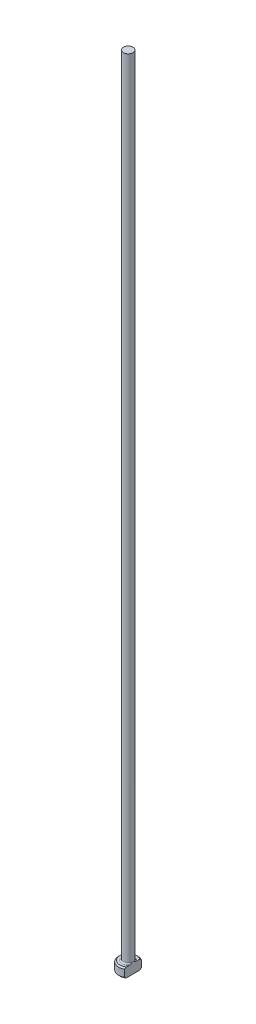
ISO-10303-21;
HEADER;
FILE_DESCRIPTION(('STEP AP214'),'2;1');
FILE_NAME('part.step','',(''),(''),'','','');
FILE_SCHEMA(('AUTOMOTIVE_DESIGN { 1 0 10303 214 1 1 1 1 }'));
ENDSEC;
DATA;
#1=APPLICATION_CONTEXT('core data for automotive mechanical design processes');
#2=APPLICATION_PROTOCOL_DEFINITION('international standard','automotive_design',2000,#1);
#3=PRODUCT_CONTEXT('',#1,'mechanical');
#4=PRODUCT('Part','Part','',(#3));
#5=PRODUCT_RELATED_PRODUCT_CATEGORY('part','',(#4));
#6=PRODUCT_DEFINITION_FORMATION('','',#4);
#7=PRODUCT_DEFINITION_CONTEXT('part definition',#1,'design');
#8=PRODUCT_DEFINITION('design','',#6,#7);
#9=PRODUCT_DEFINITION_SHAPE('','',#8);
#10=(LENGTH_UNIT() NAMED_UNIT(*) SI_UNIT(.MILLI.,.METRE.));
#11=(NAMED_UNIT(*) PLANE_ANGLE_UNIT() SI_UNIT($,.RADIAN.));
#12=(NAMED_UNIT(*) SI_UNIT($,.STERADIAN.) SOLID_ANGLE_UNIT());
#13=UNCERTAINTY_MEASURE_WITH_UNIT(LENGTH_MEASURE(1.E-05),#10,'distance_accuracy_value','');
#14=(GEOMETRIC_REPRESENTATION_CONTEXT(3) GLOBAL_UNCERTAINTY_ASSIGNED_CONTEXT((#13)) GLOBAL_UNIT_ASSIGNED_CONTEXT((#10,
#11,#12)) REPRESENTATION_CONTEXT('',''));
#15=CARTESIAN_POINT('',(0.,0.,0.));
#16=DIRECTION('',(0.,0.,1.));
#17=DIRECTION('',(1.,0.,0.));
#18=AXIS2_PLACEMENT_3D('',#15,#16,#17);
#19=CARTESIAN_POINT('',(0.,0.,0.));
#20=DIRECTION('',(0.,-1.,0.));
#21=DIRECTION('',(0.,0.,-1.));
#22=AXIS2_PLACEMENT_3D('',#19,#20,#21);
#23=PLANE('',#22);
#24=CARTESIAN_POINT('',(0.,0.,0.));
#25=DIRECTION('',(0.,-1.,0.));
#26=DIRECTION('',(0.,0.,-1.));
#27=AXIS2_PLACEMENT_3D('',#24,#25,#26);
#28=CIRCLE('',#27,1.29999999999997);
#29=CARTESIAN_POINT('',(0.749999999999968,0.,1.06183802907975));
#30=VERTEX_POINT('',#29);
#31=CARTESIAN_POINT('',(0.749999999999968,0.,-1.06183802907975));
#32=VERTEX_POINT('',#31);
#33=EDGE_CURVE('E98',#30,#32,#28,.T.);
#34=ORIENTED_EDGE('',*,*,#33,.T.);
#35=DIRECTION('',(0.,0.,1.));
#36=VECTOR('',#35,1.);
#37=CARTESIAN_POINT('',(0.749999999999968,0.,-1.29903810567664));
#38=LINE('',#37,#36);
#39=EDGE_CURVE('E83',#32,#30,#38,.T.);
#40=ORIENTED_EDGE('',*,*,#39,.T.);
#41=EDGE_LOOP('',(#34,#40));
#42=FACE_BOUND('',#41,.T.);
#43=ADVANCED_FACE('F32',(#42),#23,.T.);
#44=CARTESIAN_POINT('',(0.,259.958771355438,0.));
#45=DIRECTION('',(0.,1.,0.));
#46=DIRECTION('',(0.,0.,1.));
#47=AXIS2_PLACEMENT_3D('',#44,#45,#46);
#48=CYLINDRICAL_SURFACE('',#47,1.49999999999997);
#49=CARTESIAN_POINT('',(0.,1.29999999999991,0.));
#50=DIRECTION('',(0.,1.,0.));
#51=DIRECTION('',(0.,0.,1.));
#52=AXIS2_PLACEMENT_3D('',#49,#50,#51);
#53=CIRCLE('',#52,1.49999999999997);
#54=CARTESIAN_POINT('',(0.749999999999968,1.29999999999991,1.29903810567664));
#55=VERTEX_POINT('',#54);
#56=CARTESIAN_POINT('',(0.749999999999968,1.29999999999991,-1.29903810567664));
#57=VERTEX_POINT('',#56);
#58=EDGE_CURVE('E104',#55,#57,#53,.F.);
#59=ORIENTED_EDGE('',*,*,#58,.T.);
#60=DIRECTION('',(0.,-1.,0.));
#61=VECTOR('',#60,1.);
#62=CARTESIAN_POINT('',(0.749999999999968,125.,-1.29903810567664));
#63=LINE('',#62,#61);
#64=CARTESIAN_POINT('',(0.749999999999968,0.200000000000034,-1.29903810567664));
#65=VERTEX_POINT('',#64);
#66=EDGE_CURVE('E183',#57,#65,#63,.T.);
#67=ORIENTED_EDGE('',*,*,#66,.T.);
#68=CARTESIAN_POINT('',(0.,0.200000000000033,0.));
#69=DIRECTION('',(0.,-1.,0.));
#70=DIRECTION('',(0.,0.,-1.));
#71=AXIS2_PLACEMENT_3D('',#68,#69,#70);
#72=CIRCLE('',#71,1.49999999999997);
#73=CARTESIAN_POINT('',(0.749999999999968,0.200000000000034,1.29903810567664));
#74=VERTEX_POINT('',#73);
#75=EDGE_CURVE('E100',#65,#74,#72,.F.);
#76=ORIENTED_EDGE('',*,*,#75,.T.);
#77=DIRECTION('',(0.,-1.,0.));
#78=VECTOR('',#77,1.);
#79=CARTESIAN_POINT('',(0.749999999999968,125.,1.29903810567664));
#80=LINE('',#79,#78);
#81=EDGE_CURVE('E93',#55,#74,#80,.T.);
#82=ORIENTED_EDGE('',*,*,#81,.F.);
#83=EDGE_LOOP('',(#59,#67,#76,#82));
#84=FACE_BOUND('',#83,.T.);
#85=ADVANCED_FACE('F158',(#84),#48,.T.);
#86=CARTESIAN_POINT('',(-1.49999999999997,1.5,0.));
#87=DIRECTION('',(0.,1.,0.));
#88=DIRECTION('',(0.,0.,1.));
#89=AXIS2_PLACEMENT_3D('',#86,#87,#88);
#90=PLANE('',#89);
#91=CARTESIAN_POINT('',(0.,1.5,0.));
#92=DIRECTION('',(0.,1.,0.));
#93=DIRECTION('',(0.,0.,1.));
#94=AXIS2_PLACEMENT_3D('',#91,#92,#93);
#95=CIRCLE('',#94,1.29999999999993);
#96=CARTESIAN_POINT('',(0.749999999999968,1.5,-1.0618380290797));
#97=VERTEX_POINT('',#96);
#98=CARTESIAN_POINT('',(0.749999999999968,1.5,1.0618380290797));
#99=VERTEX_POINT('',#98);
#100=EDGE_CURVE('E178',#97,#99,#95,.T.);
#101=ORIENTED_EDGE('',*,*,#100,.T.);
#102=DIRECTION('',(0.,0.,-1.));
#103=VECTOR('',#102,1.);
#104=CARTESIAN_POINT('',(0.749999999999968,1.5,0.));
#105=LINE('',#104,#103);
#106=CARTESIAN_POINT('',(0.749999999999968,1.49999999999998,0.583095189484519));
#107=VERTEX_POINT('',#106);
#108=EDGE_CURVE('E57',#99,#107,#105,.T.);
#109=ORIENTED_EDGE('',*,*,#108,.T.);
#110=CARTESIAN_POINT('',(0.,1.5,0.));
#111=DIRECTION('',(0.,1.,0.));
#112=DIRECTION('',(0.,0.,1.));
#113=AXIS2_PLACEMENT_3D('',#110,#111,#112);
#114=CIRCLE('',#113,0.949999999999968);
#115=CARTESIAN_POINT('',(0.749999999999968,1.49999999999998,-0.583095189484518));
#116=VERTEX_POINT('',#115);
#117=EDGE_CURVE('E107',#107,#116,#114,.F.);
#118=ORIENTED_EDGE('',*,*,#117,.T.);
#119=EDGE_CURVE('E136',#116,#97,#105,.T.);
#120=ORIENTED_EDGE('',*,*,#119,.T.);
#121=EDGE_LOOP('',(#101,#109,#118,#120));
#122=FACE_BOUND('',#121,.T.);
#123=ADVANCED_FACE('F147',(#122),#90,.T.);
#124=CARTESIAN_POINT('',(0.,1.5,0.));
#125=DIRECTION('',(0.,-1.,0.));
#126=DIRECTION('',(0.,0.,-1.));
#127=AXIS2_PLACEMENT_3D('',#124,#125,#126);
#128=CONICAL_SURFACE('',#127,1.29999999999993,0.785398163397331);
#129=ORIENTED_EDGE('',*,*,#58,.F.);
#130=CARTESIAN_POINT('',(0.749999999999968,-0.159311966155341,2.86269581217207));
#131=CARTESIAN_POINT('',(0.749999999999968,-0.0964328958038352,2.79769204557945));
#132=CARTESIAN_POINT('',(0.749999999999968,-0.0336221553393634,2.73262201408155));
#133=CARTESIAN_POINT('',(0.749999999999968,0.0918244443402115,2.60231208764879));
#134=CARTESIAN_POINT('',(0.749999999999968,0.154460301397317,2.53707219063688));
#135=CARTESIAN_POINT('',(0.749999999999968,0.342109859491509,2.34097725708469));
#136=CARTESIAN_POINT('',(0.749999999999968,0.466801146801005,2.20981339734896));
#137=CARTESIAN_POINT('',(0.749999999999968,0.712328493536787,1.94880342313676));
#138=CARTESIAN_POINT('',(0.749999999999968,0.833191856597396,1.81898315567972));
#139=CARTESIAN_POINT('',(0.749999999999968,1.01264761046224,1.62259577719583));
#140=CARTESIAN_POINT('',(0.749999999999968,1.07215326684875,1.55686440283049));
#141=CARTESIAN_POINT('',(0.749999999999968,1.19029260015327,1.42462307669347));
#142=CARTESIAN_POINT('',(0.749999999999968,1.24892630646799,1.35811315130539));
#143=CARTESIAN_POINT('',(0.749999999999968,1.34237202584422,1.250039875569));
#144=CARTESIAN_POINT('',(0.749999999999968,1.37758720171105,1.20882554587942));
#145=CARTESIAN_POINT('',(0.749999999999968,1.44738925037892,1.12585980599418));
#146=CARTESIAN_POINT('',(0.749999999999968,1.48197606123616,1.08410834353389));
#147=CARTESIAN_POINT('',(0.749999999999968,1.55066668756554,0.999475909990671));
#148=CARTESIAN_POINT('',(0.749999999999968,1.58476158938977,0.956587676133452));
#149=CARTESIAN_POINT('',(0.749999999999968,1.65176028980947,0.869892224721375));
#150=CARTESIAN_POINT('',(0.749999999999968,1.68466421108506,0.826085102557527));
#151=CARTESIAN_POINT('',(0.749999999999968,1.74926316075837,0.736563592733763));
#152=CARTESIAN_POINT('',(0.749999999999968,1.78093229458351,0.690830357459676));
#153=CARTESIAN_POINT('',(0.749999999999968,1.84170221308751,0.597569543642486));
#154=CARTESIAN_POINT('',(0.749999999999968,1.87079946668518,0.550039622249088));
#155=CARTESIAN_POINT('',(0.749999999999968,1.92458416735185,0.453275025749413));
#156=CARTESIAN_POINT('',(0.749999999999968,1.94932190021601,0.404068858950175));
#157=CARTESIAN_POINT('',(0.749999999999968,1.99240172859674,0.302953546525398));
#158=CARTESIAN_POINT('',(0.749999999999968,2.0107652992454,0.251054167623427));
#159=CARTESIAN_POINT('',(0.749999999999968,2.03062801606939,0.173219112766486));
#160=CARTESIAN_POINT('',(0.749999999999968,2.03589389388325,0.148243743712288));
#161=CARTESIAN_POINT('',(0.749999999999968,2.04404463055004,0.0979002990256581));
#162=CARTESIAN_POINT('',(0.749999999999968,2.04692969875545,0.0725322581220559));
#163=CARTESIAN_POINT('',(0.749999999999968,2.05011277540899,0.0217085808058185));
#164=CARTESIAN_POINT('',(0.749999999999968,2.05041870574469,-0.00374654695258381));
#165=CARTESIAN_POINT('',(0.749999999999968,2.04844884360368,-0.054551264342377));
#166=CARTESIAN_POINT('',(0.749999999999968,2.04617283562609,-0.0799008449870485));
#167=CARTESIAN_POINT('',(0.749999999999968,2.03574038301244,-0.154989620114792));
#168=CARTESIAN_POINT('',(0.749999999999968,2.02400532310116,-0.204255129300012));
#169=CARTESIAN_POINT('',(0.749999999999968,2.00101199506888,-0.276434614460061));
#170=CARTESIAN_POINT('',(0.749999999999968,1.99241146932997,-0.300284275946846));
#171=CARTESIAN_POINT('',(0.749999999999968,1.97373056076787,-0.347397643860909));
#172=CARTESIAN_POINT('',(0.749999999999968,1.96365048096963,-0.370661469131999));
#173=CARTESIAN_POINT('',(0.749999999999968,1.93147369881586,-0.439916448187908));
#174=CARTESIAN_POINT('',(0.749999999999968,1.90754987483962,-0.485052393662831));
#175=CARTESIAN_POINT('',(0.749999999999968,1.85653851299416,-0.573518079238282));
#176=CARTESIAN_POINT('',(0.749999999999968,1.82944709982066,-0.616845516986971));
#177=CARTESIAN_POINT('',(0.749999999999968,1.77305281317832,-0.70224758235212));
#178=CARTESIAN_POINT('',(0.749999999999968,1.74374234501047,-0.74431715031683));
#179=CARTESIAN_POINT('',(0.749999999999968,1.68364081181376,-0.827390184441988));
#180=CARTESIAN_POINT('',(0.749999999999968,1.65284939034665,-0.868393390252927));
#181=CARTESIAN_POINT('',(0.749999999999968,1.55811585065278,-0.991236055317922));
#182=CARTESIAN_POINT('',(0.749999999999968,1.49256261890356,-1.07182756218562));
#183=CARTESIAN_POINT('',(0.749999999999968,1.35929153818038,-1.23084604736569));
#184=CARTESIAN_POINT('',(0.749999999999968,1.29157909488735,-1.30927763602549));
#185=CARTESIAN_POINT('',(0.749999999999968,1.16634991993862,-1.45163734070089));
#186=CARTESIAN_POINT('',(0.749999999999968,1.10905780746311,-1.51576342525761));
#187=CARTESIAN_POINT('',(0.749999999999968,0.993771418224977,-1.64338257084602));
#188=CARTESIAN_POINT('',(0.749999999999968,0.935777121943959,-1.70687561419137));
#189=CARTESIAN_POINT('',(0.749999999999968,0.76093084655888,-1.89677871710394));
#190=CARTESIAN_POINT('',(0.749999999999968,0.643323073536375,-2.02249209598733));
#191=CARTESIAN_POINT('',(0.749999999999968,0.41182883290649,-2.26768837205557));
#192=CARTESIAN_POINT('',(0.749999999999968,0.297988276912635,-2.38721485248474));
#193=CARTESIAN_POINT('',(0.749999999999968,0.069723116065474,-2.62545352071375));
#194=CARTESIAN_POINT('',(0.749999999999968,-0.0447006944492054,-2.74416646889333));
#195=CARTESIAN_POINT('',(0.749999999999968,-0.15931196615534,-2.86269581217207));
#196=B_SPLINE_CURVE_WITH_KNOTS('',3,(#130,#131,#132,#133,#134,#135,#136,#137,#138,#139,#140,
#141,#142,#143,#144,#145,#146,#147,#148,#149,#150,#151,#152,#153,#154,#155,#156,#157,#158,#159,
#160,#161,#162,#163,#164,#165,#166,#167,#168,#169,#170,#171,#172,#173,#174,#175,#176,#177,#178,
#179,#180,#181,#182,#183,#184,#185,#186,#187,#188,#189,#190,#191,#192,#193,#194,#195),
.UNSPECIFIED.,.F.,.F.,(4,2,2,2,2,2,2,2,2,2,2,2,2,2,2,2,2,2,2,2,2,2,2,2,2,2,2,2,2,2,2,2,4),(0.,
0.271318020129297,0.542639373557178,1.08555961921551,1.61765797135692,1.88364922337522,
2.14963148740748,2.31225703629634,2.47489853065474,2.63925165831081,2.80358780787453,
2.97041571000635,3.13746921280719,3.3024477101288,3.46686485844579,3.54334114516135,
3.61981070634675,3.69604530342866,3.77228626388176,3.92333298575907,3.99936293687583,
4.07537733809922,4.22841106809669,4.38163402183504,4.5354074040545,4.68921798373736,
5.00077730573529,5.31160990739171,5.56957672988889,5.82755073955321,6.34398366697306,
6.83917444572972,7.33381214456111),.UNSPECIFIED.);
#197=EDGE_CURVE('E135',#55,#99,#196,.T.);
#198=ORIENTED_EDGE('',*,*,#197,.T.);
#199=ORIENTED_EDGE('',*,*,#100,.F.);
#200=EDGE_CURVE('E127',#97,#57,#196,.T.);
#201=ORIENTED_EDGE('',*,*,#200,.T.);
#202=EDGE_LOOP('',(#129,#198,#199,#201));
#203=FACE_BOUND('',#202,.T.);
#204=ADVANCED_FACE('F143',(#203),#128,.T.);
#205=CARTESIAN_POINT('',(0.,0.200000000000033,0.));
#206=DIRECTION('',(0.,1.,0.));
#207=DIRECTION('',(0.,0.,1.));
#208=AXIS2_PLACEMENT_3D('',#205,#206,#207);
#209=CONICAL_SURFACE('',#208,1.49999999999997,0.785398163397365);
#210=ORIENTED_EDGE('',*,*,#75,.F.);
#211=CARTESIAN_POINT('',(0.749999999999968,1.65931196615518,-2.86269581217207));
#212=CARTESIAN_POINT('',(0.749999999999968,1.59643289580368,-2.79769204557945));
#213=CARTESIAN_POINT('',(0.749999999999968,1.53362215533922,-2.73262201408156));
#214=CARTESIAN_POINT('',(0.749999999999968,1.40817555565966,-2.60231208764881));
#215=CARTESIAN_POINT('',(0.749999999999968,1.34553969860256,-2.53707219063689));
#216=CARTESIAN_POINT('',(0.749999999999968,1.15789014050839,-2.34097725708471));
#217=CARTESIAN_POINT('',(0.749999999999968,1.03319885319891,-2.20981339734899));
#218=CARTESIAN_POINT('',(0.749999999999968,0.787671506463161,-1.9488034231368));
#219=CARTESIAN_POINT('',(0.749999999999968,0.666808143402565,-1.81898315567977));
#220=CARTESIAN_POINT('',(0.749999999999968,0.487352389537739,-1.6225957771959));
#221=CARTESIAN_POINT('',(0.749999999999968,0.427846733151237,-1.55686440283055));
#222=CARTESIAN_POINT('',(0.749999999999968,0.309707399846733,-1.42462307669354));
#223=CARTESIAN_POINT('',(0.749999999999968,0.251073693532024,-1.35811315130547));
#224=CARTESIAN_POINT('',(0.749999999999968,0.157627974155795,-1.25003987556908));
#225=CARTESIAN_POINT('',(0.749999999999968,0.122412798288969,-1.2088255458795));
#226=CARTESIAN_POINT('',(0.749999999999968,0.0526107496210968,-1.12585980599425));
#227=CARTESIAN_POINT('',(0.749999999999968,0.0180239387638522,-1.08410834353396));
#228=CARTESIAN_POINT('',(0.749999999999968,-0.0506666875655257,-0.999475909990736));
#229=CARTESIAN_POINT('',(0.749999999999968,-0.0847615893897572,-0.956587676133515));
#230=CARTESIAN_POINT('',(0.749999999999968,-0.151760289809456,-0.869892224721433));
#231=CARTESIAN_POINT('',(0.749999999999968,-0.184664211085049,-0.826085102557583));
#232=CARTESIAN_POINT('',(0.749999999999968,-0.249263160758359,-0.736563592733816));
#233=CARTESIAN_POINT('',(0.749999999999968,-0.280932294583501,-0.690830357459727));
#234=CARTESIAN_POINT('',(0.749999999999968,-0.3417022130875,-0.597569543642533));
#235=CARTESIAN_POINT('',(0.749999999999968,-0.370799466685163,-0.550039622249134));
#236=CARTESIAN_POINT('',(0.749999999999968,-0.424584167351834,-0.453275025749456));
#237=CARTESIAN_POINT('',(0.749999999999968,-0.449321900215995,-0.404068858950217));
#238=CARTESIAN_POINT('',(0.749999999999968,-0.492401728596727,-0.302953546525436));
#239=CARTESIAN_POINT('',(0.749999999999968,-0.510765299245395,-0.251054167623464));
#240=CARTESIAN_POINT('',(0.749999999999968,-0.530628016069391,-0.173219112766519));
#241=CARTESIAN_POINT('',(0.749999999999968,-0.535893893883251,-0.148243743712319));
#242=CARTESIAN_POINT('',(0.749999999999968,-0.544044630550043,-0.0979002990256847));
#243=CARTESIAN_POINT('',(0.749999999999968,-0.546929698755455,-0.07253225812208));
#244=CARTESIAN_POINT('',(0.749999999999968,-0.550112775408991,-0.0217085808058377));
#245=CARTESIAN_POINT('',(0.749999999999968,-0.550418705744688,0.0037465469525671));
#246=CARTESIAN_POINT('',(0.749999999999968,-0.54844884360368,0.0545512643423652));
#247=CARTESIAN_POINT('',(0.749999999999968,-0.546172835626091,0.0799008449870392));
#248=CARTESIAN_POINT('',(0.749999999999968,-0.535740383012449,0.15498962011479));
#249=CARTESIAN_POINT('',(0.749999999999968,-0.524005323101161,0.204255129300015));
#250=CARTESIAN_POINT('',(0.749999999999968,-0.50101199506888,0.276434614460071));
#251=CARTESIAN_POINT('',(0.749999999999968,-0.49241146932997,0.300284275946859));
#252=CARTESIAN_POINT('',(0.749999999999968,-0.473730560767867,0.347397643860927));
#253=CARTESIAN_POINT('',(0.749999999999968,-0.463650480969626,0.370661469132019));
#254=CARTESIAN_POINT('',(0.749999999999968,-0.431473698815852,0.439916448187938));
#255=CARTESIAN_POINT('',(0.749999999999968,-0.407549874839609,0.485052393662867));
#256=CARTESIAN_POINT('',(0.749999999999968,-0.356538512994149,0.573518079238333));
#257=CARTESIAN_POINT('',(0.749999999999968,-0.329447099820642,0.616845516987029));
#258=CARTESIAN_POINT('',(0.749999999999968,-0.273052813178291,0.702247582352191));
#259=CARTESIAN_POINT('',(0.749999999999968,-0.243742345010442,0.744317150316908));
#260=CARTESIAN_POINT('',(0.749999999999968,-0.183640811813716,0.827390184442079));
#261=CARTESIAN_POINT('',(0.749999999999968,-0.152849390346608,0.868393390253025));
#262=CARTESIAN_POINT('',(0.749999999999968,-0.0581158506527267,0.99123605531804));
#263=CARTESIAN_POINT('',(0.749999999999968,0.00743738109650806,1.07182756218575));
#264=CARTESIAN_POINT('',(0.749999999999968,0.140708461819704,1.23084604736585));
#265=CARTESIAN_POINT('',(0.749999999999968,0.208420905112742,1.30927763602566));
#266=CARTESIAN_POINT('',(0.749999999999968,0.333650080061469,1.45163734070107));
#267=CARTESIAN_POINT('',(0.749999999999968,0.390942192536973,1.51576342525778));
#268=CARTESIAN_POINT('',(0.749999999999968,0.506228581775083,1.64338257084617));
#269=CARTESIAN_POINT('',(0.749999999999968,0.56422287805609,1.70687561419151));
#270=CARTESIAN_POINT('',(0.749999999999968,0.739069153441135,1.89677871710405));
#271=CARTESIAN_POINT('',(0.749999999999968,0.856676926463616,2.02249209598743));
#272=CARTESIAN_POINT('',(0.749999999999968,1.08817116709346,2.26768837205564));
#273=CARTESIAN_POINT('',(0.749999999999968,1.20201172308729,2.3872148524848));
#274=CARTESIAN_POINT('',(0.749999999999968,1.43027688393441,2.62545352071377));
#275=CARTESIAN_POINT('',(0.749999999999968,1.54470069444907,2.74416646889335));
#276=CARTESIAN_POINT('',(0.749999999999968,1.65931196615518,2.86269581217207));
#277=B_SPLINE_CURVE_WITH_KNOTS('',3,(#211,#212,#213,#214,#215,#216,#217,#218,#219,#220,#221,
#222,#223,#224,#225,#226,#227,#228,#229,#230,#231,#232,#233,#234,#235,#236,#237,#238,#239,#240,
#241,#242,#243,#244,#245,#246,#247,#248,#249,#250,#251,#252,#253,#254,#255,#256,#257,#258,#259,
#260,#261,#262,#263,#264,#265,#266,#267,#268,#269,#270,#271,#272,#273,#274,#275,#276),
.UNSPECIFIED.,.F.,.F.,(4,2,2,2,2,2,2,2,2,2,2,2,2,2,2,2,2,2,2,2,2,2,2,2,2,2,2,2,2,2,2,2,4),(0.,
0.271318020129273,0.542639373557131,1.08555961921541,1.61765797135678,1.88364922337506,
2.1496314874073,2.31225703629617,2.47489853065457,2.63925165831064,2.80358780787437,
2.9704157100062,3.13746921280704,3.30244771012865,3.46686485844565,3.54334114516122,
3.61981070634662,3.69604530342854,3.77228626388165,3.92333298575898,3.99936293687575,
4.07537733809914,4.22841106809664,4.38163402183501,4.53540740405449,4.68921798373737,
5.00077730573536,5.31160990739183,5.56957672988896,5.82755073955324,6.34398366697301,
6.83917444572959,7.33381214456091),.UNSPECIFIED.);
#278=EDGE_CURVE('E86',#65,#32,#277,.T.);
#279=ORIENTED_EDGE('',*,*,#278,.T.);
#280=ORIENTED_EDGE('',*,*,#33,.F.);
#281=EDGE_CURVE('E89',#30,#74,#277,.T.);
#282=ORIENTED_EDGE('',*,*,#281,.T.);
#283=EDGE_LOOP('',(#210,#279,#280,#282));
#284=FACE_BOUND('',#283,.T.);
#285=ADVANCED_FACE('F97',(#284),#209,.T.);
#286=CARTESIAN_POINT('',(0.,1.69999999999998,0.));
#287=DIRECTION('',(0.,1.,0.));
#288=DIRECTION('',(0.,0.,1.));
#289=AXIS2_PLACEMENT_3D('',#286,#287,#288);
#290=TOROIDAL_SURFACE('',#289,0.949999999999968,0.2);
#291=CARTESIAN_POINT('',(0.749999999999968,1.69999999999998,0.));
#292=CARTESIAN_POINT('',(0.749999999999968,1.70000052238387,0.));
#293=CARTESIAN_POINT('',(0.749999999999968,1.70000104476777,-7.92518426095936E-08));
#294=CARTESIAN_POINT('',(0.749999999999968,1.70000206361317,-3.45345029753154E-07));
#295=CARTESIAN_POINT('',(0.749999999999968,1.70000255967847,-5.3349315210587E-07));
#296=CARTESIAN_POINT('',(0.749999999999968,1.70000354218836,-9.91557921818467E-07));
#297=CARTESIAN_POINT('',(0.749999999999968,1.70000402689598,-1.26510931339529E-06));
#298=CARTESIAN_POINT('',(0.749999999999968,1.70000495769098,-1.86638896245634E-06));
#299=CARTESIAN_POINT('',(0.749999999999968,1.70000540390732,-2.19392466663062E-06));
#300=CARTESIAN_POINT('',(0.749999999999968,1.70000683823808,-3.33370952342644E-06));
#301=CARTESIAN_POINT('',(0.749999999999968,1.70000776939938,-4.21820142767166E-06));
#302=CARTESIAN_POINT('',(0.749999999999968,1.70000948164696,-6.08403165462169E-06));
#303=CARTESIAN_POINT('',(0.749999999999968,1.70001026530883,-7.06314143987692E-06));
#304=CARTESIAN_POINT('',(0.749999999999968,1.70001305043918,-1.07283299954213E-05));
#305=CARTESIAN_POINT('',(0.749999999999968,1.70001489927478,-1.35334970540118E-05));
#306=CARTESIAN_POINT('',(0.749999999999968,1.70001806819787,-1.91887701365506E-05));
#307=CARTESIAN_POINT('',(0.749999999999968,1.70001941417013,-2.20250297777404E-05));
#308=CARTESIAN_POINT('',(0.749999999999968,1.700024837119,-3.36357626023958E-05));
#309=CARTESIAN_POINT('',(0.749999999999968,1.70002876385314,-4.24755661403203E-05));
#310=CARTESIAN_POINT('',(0.749999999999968,1.70003535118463,-5.93015818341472E-05));
#311=CARTESIAN_POINT('',(0.749999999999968,1.70003811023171,-6.72480836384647E-05));
#312=CARTESIAN_POINT('',(0.749999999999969,1.70005910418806,-0.000122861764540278));
#313=CARTESIAN_POINT('',(0.749999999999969,1.7000847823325,-0.000167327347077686));
#314=CARTESIAN_POINT('',(0.749999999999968,1.70017912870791,-0.000337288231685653));
#315=CARTESIAN_POINT('',(0.749999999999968,1.70024226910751,-0.000465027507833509));
#316=CARTESIAN_POINT('',(0.749999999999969,1.70048606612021,-0.000950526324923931));
#317=CARTESIAN_POINT('',(0.749999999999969,1.70067249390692,-0.00130597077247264));
#318=CARTESIAN_POINT('',(0.749999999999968,1.70141452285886,-0.00272815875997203));
#319=CARTESIAN_POINT('',(0.749999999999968,1.70196367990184,-0.00379745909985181));
#320=CARTESIAN_POINT('',(0.749999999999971,1.71079317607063,-0.0209810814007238));
#321=CARTESIAN_POINT('',(0.749999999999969,1.71912708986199,-0.0370747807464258));
#322=CARTESIAN_POINT('',(0.749999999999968,1.7353816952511,-0.068794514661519));
#323=CARTESIAN_POINT('',(0.749999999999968,1.74330692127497,-0.0844183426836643));
#324=CARTESIAN_POINT('',(0.749999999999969,1.75980152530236,-0.11741223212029));
#325=CARTESIAN_POINT('',(0.749999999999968,1.76835063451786,-0.134792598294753));
#326=CARTESIAN_POINT('',(0.749999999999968,1.7851625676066,-0.169887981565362));
#327=CARTESIAN_POINT('',(0.749999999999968,1.79342203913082,-0.187604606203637));
#328=CARTESIAN_POINT('',(0.749999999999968,1.81367684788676,-0.232718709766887));
#329=CARTESIAN_POINT('',(0.749999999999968,1.82533268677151,-0.260271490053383));
#330=CARTESIAN_POINT('',(0.749999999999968,1.84666110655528,-0.315501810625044));
#331=CARTESIAN_POINT('',(0.749999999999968,1.85636938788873,-0.34316526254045));
#332=CARTESIAN_POINT('',(0.749999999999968,1.87268127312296,-0.396748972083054));
#333=CARTESIAN_POINT('',(0.749999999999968,1.87948325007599,-0.42260763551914));
#334=CARTESIAN_POINT('',(0.749999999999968,1.89076706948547,-0.476103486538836));
#335=CARTESIAN_POINT('',(0.749999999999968,1.89512718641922,-0.50376764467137));
#336=CARTESIAN_POINT('',(0.749999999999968,1.90012258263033,-0.559350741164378));
#337=CARTESIAN_POINT('',(0.749999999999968,1.90077276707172,-0.587268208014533));
#338=CARTESIAN_POINT('',(0.749999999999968,1.8972553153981,-0.64249646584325));
#339=CARTESIAN_POINT('',(0.749999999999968,1.89315871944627,-0.669810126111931));
#340=CARTESIAN_POINT('',(0.749999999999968,1.88226759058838,-0.710376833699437));
#341=CARTESIAN_POINT('',(0.749999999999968,1.87764112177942,-0.724213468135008));
#342=CARTESIAN_POINT('',(0.749999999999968,1.8664543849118,-0.751128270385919));
#343=CARTESIAN_POINT('',(0.749999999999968,1.85989169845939,-0.764205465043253));
#344=CARTESIAN_POINT('',(0.749999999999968,1.84591711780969,-0.787020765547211));
#345=CARTESIAN_POINT('',(0.749999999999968,1.83882518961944,-0.796953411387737));
#346=CARTESIAN_POINT('',(0.749999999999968,1.82312129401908,-0.815534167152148));
#347=CARTESIAN_POINT('',(0.749999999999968,1.81451194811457,-0.824184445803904));
#348=CARTESIAN_POINT('',(0.749999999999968,1.79770708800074,-0.838172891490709));
#349=CARTESIAN_POINT('',(0.749999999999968,1.78977561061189,-0.84382734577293));
#350=CARTESIAN_POINT('',(0.749999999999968,1.77308433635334,-0.853755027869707));
#351=CARTESIAN_POINT('',(0.749999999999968,1.76432487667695,-0.858028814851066));
#352=CARTESIAN_POINT('',(0.749999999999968,1.74611994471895,-0.864966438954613));
#353=CARTESIAN_POINT('',(0.749999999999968,1.73667052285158,-0.867620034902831));
#354=CARTESIAN_POINT('',(0.749999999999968,1.71743927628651,-0.871086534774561));
#355=CARTESIAN_POINT('',(0.749999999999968,1.70765762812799,-0.871900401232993));
#356=CARTESIAN_POINT('',(0.749999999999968,1.68916476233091,-0.871644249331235));
#357=CARTESIAN_POINT('',(0.749999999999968,1.68045031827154,-0.870765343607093));
#358=CARTESIAN_POINT('',(0.749999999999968,1.66329782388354,-0.867547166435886));
#359=CARTESIAN_POINT('',(0.749999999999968,1.65485975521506,-0.865207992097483));
#360=CARTESIAN_POINT('',(0.749999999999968,1.63851016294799,-0.859212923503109));
#361=CARTESIAN_POINT('',(0.749999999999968,1.63059660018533,-0.855562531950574));
#362=CARTESIAN_POINT('',(0.749999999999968,1.61540880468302,-0.847119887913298));
#363=CARTESIAN_POINT('',(0.749999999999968,1.60813470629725,-0.842327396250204));
#364=CARTESIAN_POINT('',(0.749999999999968,1.59350795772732,-0.831172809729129));
#365=CARTESIAN_POINT('',(0.749999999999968,1.58624574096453,-0.82469266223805));
#366=CARTESIAN_POINT('',(0.749999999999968,1.57268239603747,-0.810794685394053));
#367=CARTESIAN_POINT('',(0.749999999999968,1.56638225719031,-0.803375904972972));
#368=CARTESIAN_POINT('',(0.749999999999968,1.55147186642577,-0.783446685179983));
#369=CARTESIAN_POINT('',(0.749999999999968,1.54355238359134,-0.770417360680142));
#370=CARTESIAN_POINT('',(0.749999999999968,1.52991429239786,-0.743286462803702));
#371=CARTESIAN_POINT('',(0.749999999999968,1.52419651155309,-0.729184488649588));
#372=CARTESIAN_POINT('',(0.749999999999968,1.51257018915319,-0.693822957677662));
#373=CARTESIAN_POINT('',(0.749999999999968,1.50774380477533,-0.672209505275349));
#374=CARTESIAN_POINT('',(0.749999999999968,1.50145191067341,-0.628298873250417));
#375=CARTESIAN_POINT('',(0.749999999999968,1.5000267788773,-0.605996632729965));
#376=CARTESIAN_POINT('',(0.749999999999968,1.49995578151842,-0.546111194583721));
#377=CARTESIAN_POINT('',(0.749999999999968,1.50388309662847,-0.508527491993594));
#378=CARTESIAN_POINT('',(0.749999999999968,1.51373246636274,-0.453837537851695));
#379=CARTESIAN_POINT('',(0.749999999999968,1.51754666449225,-0.436272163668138));
#380=CARTESIAN_POINT('',(0.749999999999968,1.52621031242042,-0.401484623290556));
#381=CARTESIAN_POINT('',(0.749999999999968,1.53105449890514,-0.384261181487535));
#382=CARTESIAN_POINT('',(0.749999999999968,1.54486296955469,-0.339542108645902));
#383=CARTESIAN_POINT('',(0.749999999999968,1.55452531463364,-0.312264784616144));
#384=CARTESIAN_POINT('',(0.749999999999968,1.57570310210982,-0.257776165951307));
#385=CARTESIAN_POINT('',(0.749999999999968,1.58725400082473,-0.230578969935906));
#386=CARTESIAN_POINT('',(0.749999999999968,1.60733071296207,-0.18597536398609));
#387=CARTESIAN_POINT('',(0.749999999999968,1.6155301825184,-0.168419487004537));
#388=CARTESIAN_POINT('',(0.749999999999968,1.63221303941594,-0.133639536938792));
#389=CARTESIAN_POINT('',(0.749999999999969,1.64069316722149,-0.116413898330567));
#390=CARTESIAN_POINT('',(0.749999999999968,1.65705001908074,-0.0837133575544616));
#391=CARTESIAN_POINT('',(0.749999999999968,1.66490699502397,-0.0682284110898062));
#392=CARTESIAN_POINT('',(0.749999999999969,1.68101978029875,-0.0367899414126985));
#393=CARTESIAN_POINT('',(0.749999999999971,1.68928002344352,-0.0208385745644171));
#394=CARTESIAN_POINT('',(0.749999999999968,1.69803632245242,-0.00379745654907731));
#395=CARTESIAN_POINT('',(0.749999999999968,1.69858548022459,-0.00272815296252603));
#396=CARTESIAN_POINT('',(0.749999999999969,1.69932750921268,-0.00130596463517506));
#397=CARTESIAN_POINT('',(0.749999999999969,1.69951393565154,-0.000950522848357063));
#398=CARTESIAN_POINT('',(0.749999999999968,1.69975773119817,-0.000465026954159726));
#399=CARTESIAN_POINT('',(0.749999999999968,1.6998208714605,-0.000337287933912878));
#400=CARTESIAN_POINT('',(0.749999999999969,1.69991521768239,-0.00016732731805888));
#401=CARTESIAN_POINT('',(0.749999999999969,1.69994089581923,-0.000122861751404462));
#402=CARTESIAN_POINT('',(0.749999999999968,1.69996188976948,-6.72480869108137E-05));
#403=CARTESIAN_POINT('',(0.749999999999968,1.69996464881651,-5.93015849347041E-05));
#404=CARTESIAN_POINT('',(0.749999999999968,1.6999712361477,-4.24755687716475E-05));
#405=CARTESIAN_POINT('',(0.749999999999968,1.69997516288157,-3.36357649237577E-05));
#406=CARTESIAN_POINT('',(0.749999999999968,1.69998058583,-2.20250315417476E-05));
#407=CARTESIAN_POINT('',(0.749999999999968,1.69998193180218,-1.91887716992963E-05));
#408=CARTESIAN_POINT('',(0.749999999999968,1.69998510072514,-1.35334981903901E-05));
#409=CARTESIAN_POINT('',(0.749999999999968,1.69998694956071,-1.07283309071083E-05));
#410=CARTESIAN_POINT('',(0.749999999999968,1.69998973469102,-7.06314205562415E-06));
#411=CARTESIAN_POINT('',(0.749999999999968,1.69999051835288,-6.08403219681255E-06));
#412=CARTESIAN_POINT('',(0.749999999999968,1.69999223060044,-4.21820182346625E-06));
#413=CARTESIAN_POINT('',(0.749999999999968,1.69999316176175,-3.33370984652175E-06));
#414=CARTESIAN_POINT('',(0.749999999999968,1.69999459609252,-2.19392489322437E-06));
#415=CARTESIAN_POINT('',(0.749999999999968,1.69999504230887,-1.86638916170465E-06));
#416=CARTESIAN_POINT('',(0.749999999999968,1.69999597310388,-1.26510946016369E-06));
#417=CARTESIAN_POINT('',(0.749999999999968,1.69999645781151,-9.91558043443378E-07));
#418=CARTESIAN_POINT('',(0.749999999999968,1.69999744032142,-5.33493228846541E-07));
#419=CARTESIAN_POINT('',(0.749999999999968,1.69999793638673,-3.453450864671E-07));
#420=CARTESIAN_POINT('',(0.749999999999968,1.69999895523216,-7.92518654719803E-08));
#421=CARTESIAN_POINT('',(0.749999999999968,1.69999947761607,0.));
#422=CARTESIAN_POINT('',(0.749999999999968,1.69999999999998,0.));
#423=B_SPLINE_CURVE_WITH_KNOTS('',3,(#291,#292,#293,#294,#295,#296,#297,#298,#299,#300,#301,
#302,#303,#304,#305,#306,#307,#308,#309,#310,#311,#312,#313,#314,#315,#316,#317,#318,#319,#320,
#321,#322,#323,#324,#325,#326,#327,#328,#329,#330,#331,#332,#333,#334,#335,#336,#337,#338,#339,
#340,#341,#342,#343,#344,#345,#346,#347,#348,#349,#350,#351,#352,#353,#354,#355,#356,#357,#358,
#359,#360,#361,#362,#363,#364,#365,#366,#367,#368,#369,#370,#371,#372,#373,#374,#375,#376,#377,
#378,#379,#380,#381,#382,#383,#384,#385,#386,#387,#388,#389,#390,#391,#392,#393,#394,#395,#396,
#397,#398,#399,#400,#401,#402,#403,#404,#405,#406,#407,#408,#409,#410,#411,#412,#413,#414,#415,
#416,#417,#418,#419,#420,#421,#422),.UNSPECIFIED.,.T.,.F.,(4,2,2,2,2,2,2,2,2,2,2,2,2,2,2,2,2,2,
2,2,2,2,2,2,2,2,2,2,2,2,2,2,2,2,2,2,2,2,2,2,2,2,2,2,2,2,2,2,2,2,2,2,2,2,2,2,2,2,2,2,2,2,2,2,2,
4),(0.,1.56543920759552E-06,3.1500654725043E-06,4.81434344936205E-06,6.47280881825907E-06,
1.03067366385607E-05,1.4065794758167E-05,2.41046688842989E-05,3.35140857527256E-05,
6.25197196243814E-05,8.77289706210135E-05,0.000240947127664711,0.000669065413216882,
0.00187238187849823,0.00547938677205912,0.0598417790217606,0.112399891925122,0.170503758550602,
0.229141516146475,0.318850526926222,0.406723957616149,0.486842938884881,0.570663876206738,
0.654147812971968,0.736398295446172,0.780052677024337,0.823761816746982,0.860241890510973,
0.896659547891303,0.925764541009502,0.954857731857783,0.98413296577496,1.01339287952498,
1.03954157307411,1.06568852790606,1.09172701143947,1.11777095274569,1.14686281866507,
1.17598440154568,1.22146737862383,1.26696743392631,1.33303548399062,1.39988404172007,
1.51253340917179,1.56644503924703,1.62008752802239,1.70682485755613,1.79543193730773,
1.85355663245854,1.91115281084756,1.96324672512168,2.01712839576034,2.02073541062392,
2.02193871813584,2.02236683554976,2.02252005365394,2.02254526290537,2.02257426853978,
2.02258367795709,2.02259371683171,2.02259747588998,2.02260130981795,2.02260296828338,
2.02260463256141,2.02260621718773,2.02260778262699),.UNSPECIFIED.);
#424=CARTESIAN_POINT('',(0.749999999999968,1.69999999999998,0.));
#425=VERTEX_POINT('',#424);
#426=EDGE_CURVE('E11',#116,#425,#423,.T.);
#427=ORIENTED_EDGE('',*,*,#426,.F.);
#428=ORIENTED_EDGE('',*,*,#117,.F.);
#429=CARTESIAN_POINT('',(0.749999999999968,1.69999999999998,0.));
#430=CARTESIAN_POINT('',(0.749999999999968,1.69999947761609,0.));
#431=CARTESIAN_POINT('',(0.749999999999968,1.69999895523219,7.92518426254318E-08));
#432=CARTESIAN_POINT('',(0.749999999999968,1.69999793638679,3.45345029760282E-07));
#433=CARTESIAN_POINT('',(0.749999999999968,1.69999744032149,5.33493152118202E-07));
#434=CARTESIAN_POINT('',(0.749999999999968,1.6999964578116,9.91557921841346E-07));
#435=CARTESIAN_POINT('',(0.749999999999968,1.69999597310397,1.26510931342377E-06));
#436=CARTESIAN_POINT('',(0.749999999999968,1.69999504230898,1.86638896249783E-06));
#437=CARTESIAN_POINT('',(0.749999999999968,1.69999459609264,2.19392466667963E-06));
#438=CARTESIAN_POINT('',(0.749999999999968,1.69999316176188,3.33370952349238E-06));
#439=CARTESIAN_POINT('',(0.749999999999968,1.69999223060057,4.21820142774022E-06));
#440=CARTESIAN_POINT('',(0.749999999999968,1.699990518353,6.08403165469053E-06));
#441=CARTESIAN_POINT('',(0.749999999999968,1.69998973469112,7.06314143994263E-06));
#442=CARTESIAN_POINT('',(0.749999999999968,1.69998694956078,1.07283299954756E-05));
#443=CARTESIAN_POINT('',(0.749999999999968,1.69998510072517,1.35334970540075E-05));
#444=CARTESIAN_POINT('',(0.749999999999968,1.69998193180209,1.91887701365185E-05));
#445=CARTESIAN_POINT('',(0.749999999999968,1.69998058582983,2.20250297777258E-05));
#446=CARTESIAN_POINT('',(0.749999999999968,1.69997516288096,3.36357626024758E-05));
#447=CARTESIAN_POINT('',(0.749999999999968,1.69997123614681,4.24755661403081E-05));
#448=CARTESIAN_POINT('',(0.749999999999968,1.69996464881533,5.93015818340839E-05));
#449=CARTESIAN_POINT('',(0.749999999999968,1.69996188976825,6.72480836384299E-05));
#450=CARTESIAN_POINT('',(0.749999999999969,1.6999408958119,0.000122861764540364));
#451=CARTESIAN_POINT('',(0.749999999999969,1.69991521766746,0.00016732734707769));
#452=CARTESIAN_POINT('',(0.749999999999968,1.69982087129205,0.000337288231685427));
#453=CARTESIAN_POINT('',(0.749999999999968,1.69975773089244,0.000465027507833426));
#454=CARTESIAN_POINT('',(0.749999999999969,1.69951393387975,0.000950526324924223));
#455=CARTESIAN_POINT('',(0.749999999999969,1.69932750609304,0.00130597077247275));
#456=CARTESIAN_POINT('',(0.749999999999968,1.6985854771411,0.00272815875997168));
#457=CARTESIAN_POINT('',(0.749999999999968,1.69803632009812,0.00379745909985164));
#458=CARTESIAN_POINT('',(0.749999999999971,1.68920682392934,0.0209810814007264));
#459=CARTESIAN_POINT('',(0.749999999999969,1.68087291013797,0.0370747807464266));
#460=CARTESIAN_POINT('',(0.749999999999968,1.66461830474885,0.0687945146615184));
#461=CARTESIAN_POINT('',(0.749999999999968,1.65669307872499,0.0844183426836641));
#462=CARTESIAN_POINT('',(0.749999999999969,1.6401984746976,0.11741223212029));
#463=CARTESIAN_POINT('',(0.749999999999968,1.6316493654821,0.134792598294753));
#464=CARTESIAN_POINT('',(0.749999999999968,1.61483743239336,0.169887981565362));
#465=CARTESIAN_POINT('',(0.749999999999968,1.60657796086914,0.187604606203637));
#466=CARTESIAN_POINT('',(0.749999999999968,1.5863231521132,0.232718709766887));
#467=CARTESIAN_POINT('',(0.749999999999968,1.57466731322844,0.260271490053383));
#468=CARTESIAN_POINT('',(0.749999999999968,1.55333889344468,0.315501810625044));
#469=CARTESIAN_POINT('',(0.749999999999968,1.54363061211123,0.34316526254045));
#470=CARTESIAN_POINT('',(0.749999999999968,1.52731872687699,0.396748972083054));
#471=CARTESIAN_POINT('',(0.749999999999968,1.52051674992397,0.42260763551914));
#472=CARTESIAN_POINT('',(0.749999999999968,1.50923293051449,0.476103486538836));
#473=CARTESIAN_POINT('',(0.749999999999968,1.50487281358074,0.50376764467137));
#474=CARTESIAN_POINT('',(0.749999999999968,1.49987741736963,0.559350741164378));
#475=CARTESIAN_POINT('',(0.749999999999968,1.49922723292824,0.587268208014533));
#476=CARTESIAN_POINT('',(0.749999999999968,1.50274468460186,0.64249646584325));
#477=CARTESIAN_POINT('',(0.749999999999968,1.50684128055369,0.669810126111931));
#478=CARTESIAN_POINT('',(0.749999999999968,1.51773240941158,0.710376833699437));
#479=CARTESIAN_POINT('',(0.749999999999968,1.52235887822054,0.724213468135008));
#480=CARTESIAN_POINT('',(0.749999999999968,1.53354561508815,0.751128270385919));
#481=CARTESIAN_POINT('',(0.749999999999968,1.54010830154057,0.764205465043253));
#482=CARTESIAN_POINT('',(0.749999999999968,1.55408288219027,0.787020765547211));
#483=CARTESIAN_POINT('',(0.749999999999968,1.56117481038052,0.796953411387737));
#484=CARTESIAN_POINT('',(0.749999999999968,1.57687870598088,0.815534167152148));
#485=CARTESIAN_POINT('',(0.749999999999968,1.58548805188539,0.824184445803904));
#486=CARTESIAN_POINT('',(0.749999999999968,1.60229291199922,0.838172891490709));
#487=CARTESIAN_POINT('',(0.749999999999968,1.61022438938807,0.84382734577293));
#488=CARTESIAN_POINT('',(0.749999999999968,1.62691566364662,0.853755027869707));
#489=CARTESIAN_POINT('',(0.749999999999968,1.635675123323,0.858028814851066));
#490=CARTESIAN_POINT('',(0.749999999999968,1.653880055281,0.864966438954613));
#491=CARTESIAN_POINT('',(0.749999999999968,1.66332947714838,0.867620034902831));
#492=CARTESIAN_POINT('',(0.749999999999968,1.68256072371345,0.871086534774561));
#493=CARTESIAN_POINT('',(0.749999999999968,1.69234237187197,0.871900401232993));
#494=CARTESIAN_POINT('',(0.749999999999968,1.71083523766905,0.871644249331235));
#495=CARTESIAN_POINT('',(0.749999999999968,1.71954968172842,0.870765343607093));
#496=CARTESIAN_POINT('',(0.749999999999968,1.73670217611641,0.867547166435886));
#497=CARTESIAN_POINT('',(0.749999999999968,1.7451402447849,0.865207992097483));
#498=CARTESIAN_POINT('',(0.749999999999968,1.76148983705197,0.859212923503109));
#499=CARTESIAN_POINT('',(0.749999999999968,1.76940339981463,0.855562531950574));
#500=CARTESIAN_POINT('',(0.749999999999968,1.78459119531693,0.847119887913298));
#501=CARTESIAN_POINT('',(0.749999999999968,1.7918652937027,0.842327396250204));
#502=CARTESIAN_POINT('',(0.749999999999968,1.80649204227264,0.831172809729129));
#503=CARTESIAN_POINT('',(0.749999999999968,1.81375425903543,0.82469266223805));
#504=CARTESIAN_POINT('',(0.749999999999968,1.82731760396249,0.810794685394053));
#505=CARTESIAN_POINT('',(0.749999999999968,1.83361774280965,0.803375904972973));
#506=CARTESIAN_POINT('',(0.749999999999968,1.84852813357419,0.783446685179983));
#507=CARTESIAN_POINT('',(0.749999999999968,1.85644761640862,0.770417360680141));
#508=CARTESIAN_POINT('',(0.749999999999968,1.8700857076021,0.743286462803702));
#509=CARTESIAN_POINT('',(0.749999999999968,1.87580348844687,0.729184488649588));
#510=CARTESIAN_POINT('',(0.749999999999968,1.88742981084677,0.693822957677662));
#511=CARTESIAN_POINT('',(0.749999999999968,1.89225619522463,0.672209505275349));
#512=CARTESIAN_POINT('',(0.749999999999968,1.89854808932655,0.628298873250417));
#513=CARTESIAN_POINT('',(0.749999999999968,1.89997322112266,0.605996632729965));
#514=CARTESIAN_POINT('',(0.749999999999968,1.90004421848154,0.546111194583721));
#515=CARTESIAN_POINT('',(0.749999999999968,1.89611690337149,0.508527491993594));
#516=CARTESIAN_POINT('',(0.749999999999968,1.88626753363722,0.453837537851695));
#517=CARTESIAN_POINT('',(0.749999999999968,1.88245333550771,0.436272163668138));
#518=CARTESIAN_POINT('',(0.749999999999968,1.87378968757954,0.401484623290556));
#519=CARTESIAN_POINT('',(0.749999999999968,1.86894550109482,0.384261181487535));
#520=CARTESIAN_POINT('',(0.749999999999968,1.85513703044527,0.339542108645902));
#521=CARTESIAN_POINT('',(0.749999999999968,1.84547468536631,0.312264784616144));
#522=CARTESIAN_POINT('',(0.749999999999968,1.82429689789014,0.257776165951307));
#523=CARTESIAN_POINT('',(0.749999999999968,1.81274599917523,0.230578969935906));
#524=CARTESIAN_POINT('',(0.749999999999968,1.79266928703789,0.18597536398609));
#525=CARTESIAN_POINT('',(0.749999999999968,1.78446981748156,0.168419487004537));
#526=CARTESIAN_POINT('',(0.749999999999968,1.76778696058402,0.133639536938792));
#527=CARTESIAN_POINT('',(0.749999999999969,1.75930683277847,0.116413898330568));
#528=CARTESIAN_POINT('',(0.749999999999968,1.74294998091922,0.0837133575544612));
#529=CARTESIAN_POINT('',(0.749999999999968,1.73509300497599,0.0682284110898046));
#530=CARTESIAN_POINT('',(0.749999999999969,1.71898021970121,0.0367899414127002));
#531=CARTESIAN_POINT('',(0.749999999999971,1.71071997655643,0.0208385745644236));
#532=CARTESIAN_POINT('',(0.749999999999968,1.70196367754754,0.00379745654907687));
#533=CARTESIAN_POINT('',(0.749999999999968,1.70141451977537,0.0027281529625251));
#534=CARTESIAN_POINT('',(0.749999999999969,1.70067249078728,0.00130596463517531));
#535=CARTESIAN_POINT('',(0.749999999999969,1.70048606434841,0.000950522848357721));
#536=CARTESIAN_POINT('',(0.749999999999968,1.70024226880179,0.000465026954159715));
#537=CARTESIAN_POINT('',(0.749999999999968,1.70017912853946,0.000337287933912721));
#538=CARTESIAN_POINT('',(0.749999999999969,1.70008478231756,0.000167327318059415));
#539=CARTESIAN_POINT('',(0.749999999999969,1.70005910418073,0.000122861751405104));
#540=CARTESIAN_POINT('',(0.749999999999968,1.70003811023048,6.72480869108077E-05));
#541=CARTESIAN_POINT('',(0.749999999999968,1.70003535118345,5.93015849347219E-05));
#542=CARTESIAN_POINT('',(0.749999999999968,1.70002876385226,4.24755687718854E-05));
#543=CARTESIAN_POINT('',(0.749999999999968,1.70002483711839,3.36357649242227E-05));
#544=CARTESIAN_POINT('',(0.749999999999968,1.70001941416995,2.20250315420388E-05));
#545=CARTESIAN_POINT('',(0.749999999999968,1.70001806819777,1.91887716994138E-05));
#546=CARTESIAN_POINT('',(0.749999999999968,1.70001489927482,1.35334981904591E-05));
#547=CARTESIAN_POINT('',(0.749999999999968,1.70001305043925,1.07283309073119E-05));
#548=CARTESIAN_POINT('',(0.749999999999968,1.70001026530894,7.06314205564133E-06));
#549=CARTESIAN_POINT('',(0.749999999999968,1.70000948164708,6.08403219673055E-06));
#550=CARTESIAN_POINT('',(0.749999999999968,1.70000776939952,4.21820182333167E-06));
#551=CARTESIAN_POINT('',(0.749999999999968,1.70000683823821,3.3337098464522E-06));
#552=CARTESIAN_POINT('',(0.749999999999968,1.70000540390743,2.19392489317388E-06));
#553=CARTESIAN_POINT('',(0.749999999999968,1.70000495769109,1.86638916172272E-06));
#554=CARTESIAN_POINT('',(0.749999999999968,1.70000402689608,1.26510946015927E-06));
#555=CARTESIAN_POINT('',(0.749999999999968,1.70000354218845,9.91558043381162E-07));
#556=CARTESIAN_POINT('',(0.749999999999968,1.70000255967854,5.33493228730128E-07));
#557=CARTESIAN_POINT('',(0.749999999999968,1.70000206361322,3.4534508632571E-07));
#558=CARTESIAN_POINT('',(0.749999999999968,1.7000010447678,7.92518653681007E-08));
#559=CARTESIAN_POINT('',(0.749999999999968,1.70000052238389,0.));
#560=CARTESIAN_POINT('',(0.749999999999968,1.69999999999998,0.));
#561=B_SPLINE_CURVE_WITH_KNOTS('',3,(#429,#430,#431,#432,#433,#434,#435,#436,#437,#438,#439,
#440,#441,#442,#443,#444,#445,#446,#447,#448,#449,#450,#451,#452,#453,#454,#455,#456,#457,#458,
#459,#460,#461,#462,#463,#464,#465,#466,#467,#468,#469,#470,#471,#472,#473,#474,#475,#476,#477,
#478,#479,#480,#481,#482,#483,#484,#485,#486,#487,#488,#489,#490,#491,#492,#493,#494,#495,#496,
#497,#498,#499,#500,#501,#502,#503,#504,#505,#506,#507,#508,#509,#510,#511,#512,#513,#514,#515,
#516,#517,#518,#519,#520,#521,#522,#523,#524,#525,#526,#527,#528,#529,#530,#531,#532,#533,#534,
#535,#536,#537,#538,#539,#540,#541,#542,#543,#544,#545,#546,#547,#548,#549,#550,#551,#552,#553,
#554,#555,#556,#557,#558,#559,#560),.UNSPECIFIED.,.T.,.F.,(4,2,2,2,2,2,2,2,2,2,2,2,2,2,2,2,2,2,
2,2,2,2,2,2,2,2,2,2,2,2,2,2,2,2,2,2,2,2,2,2,2,2,2,2,2,2,2,2,2,2,2,2,2,2,2,2,2,2,2,2,2,2,2,2,2,
4),(0.,1.56543920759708E-06,3.15006547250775E-06,4.81434344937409E-06,6.4728088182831E-06,
1.03067366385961E-05,1.40657947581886E-05,2.41046688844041E-05,3.35140857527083E-05,
6.2519719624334E-05,8.77289706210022E-05,0.000240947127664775,0.000669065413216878,
0.00187238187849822,0.00547938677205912,0.0598417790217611,0.112399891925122,0.170503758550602,
0.229141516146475,0.318850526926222,0.406723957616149,0.486842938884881,0.570663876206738,
0.654147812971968,0.736398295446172,0.780052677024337,0.823761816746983,0.860241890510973,
0.896659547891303,0.925764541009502,0.954857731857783,0.98413296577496,1.01339287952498,
1.03954157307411,1.06568852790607,1.09172701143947,1.11777095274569,1.14686281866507,
1.17598440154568,1.22146737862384,1.26696743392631,1.33303548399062,1.39988404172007,
1.51253340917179,1.56644503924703,1.62008752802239,1.70682485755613,1.79543193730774,
1.85355663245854,1.91115281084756,1.96324672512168,2.01712839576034,2.02073541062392,
2.02193871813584,2.02236683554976,2.02252005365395,2.02254526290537,2.02257426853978,
2.02258367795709,2.02259371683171,2.02259747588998,2.02260130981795,2.02260296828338,
2.02260463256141,2.02260621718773,2.02260778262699),.UNSPECIFIED.);
#562=EDGE_CURVE('E46',#425,#107,#561,.T.);
#563=ORIENTED_EDGE('',*,*,#562,.F.);
#564=CARTESIAN_POINT('',(0.,1.69999999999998,0.));
#565=DIRECTION('',(0.,1.,0.));
#566=DIRECTION('',(0.,0.,1.));
#567=AXIS2_PLACEMENT_3D('',#564,#565,#566);
#568=CIRCLE('',#567,0.749999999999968);
#569=EDGE_CURVE('E103',#425,#425,#568,.T.);
#570=ORIENTED_EDGE('',*,*,#569,.F.);
#571=EDGE_LOOP('',(#427,#428,#563,#570));
#572=FACE_BOUND('',#571,.T.);
#573=ADVANCED_FACE('F34',(#572),#290,.F.);
#574=CARTESIAN_POINT('',(0.,259.958771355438,0.));
#575=DIRECTION('',(0.,1.,0.));
#576=DIRECTION('',(0.,0.,1.));
#577=AXIS2_PLACEMENT_3D('',#574,#575,#576);
#578=CYLINDRICAL_SURFACE('',#577,0.749999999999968);
#579=ORIENTED_EDGE('',*,*,#569,.T.);
#580=EDGE_LOOP('',(#579));
#581=FACE_BOUND('',#580,.T.);
#582=CARTESIAN_POINT('',(0.,125.,0.));
#583=DIRECTION('',(0.,1.,0.));
#584=DIRECTION('',(0.,0.,1.));
#585=AXIS2_PLACEMENT_3D('',#582,#583,#584);
#586=CIRCLE('',#585,0.749999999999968);
#587=CARTESIAN_POINT('',(0.,125.,0.749999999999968));
#588=VERTEX_POINT('',#587);
#589=EDGE_CURVE('E101',#588,#588,#586,.T.);
#590=ORIENTED_EDGE('',*,*,#589,.F.);
#591=EDGE_LOOP('',(#590));
#592=FACE_BOUND('',#591,.T.);
#593=ADVANCED_FACE('F155',(#581,#592),#578,.T.);
#594=CARTESIAN_POINT('',(-0.749999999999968,125.,0.));
#595=DIRECTION('',(0.,1.,0.));
#596=DIRECTION('',(0.,0.,1.));
#597=AXIS2_PLACEMENT_3D('',#594,#595,#596);
#598=PLANE('',#597);
#599=ORIENTED_EDGE('',*,*,#589,.T.);
#600=EDGE_LOOP('',(#599));
#601=FACE_BOUND('',#600,.T.);
#602=ADVANCED_FACE('F121',(#601),#598,.T.);
#603=CARTESIAN_POINT('',(0.749999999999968,125.,-1.29903810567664));
#604=DIRECTION('',(1.,0.,0.));
#605=DIRECTION('',(0.,0.,-1.));
#606=AXIS2_PLACEMENT_3D('',#603,#604,#605);
#607=PLANE('',#606);
#608=ORIENTED_EDGE('',*,*,#66,.F.);
#609=ORIENTED_EDGE('',*,*,#200,.F.);
#610=ORIENTED_EDGE('',*,*,#119,.F.);
#611=ORIENTED_EDGE('',*,*,#426,.T.);
#612=ORIENTED_EDGE('',*,*,#562,.T.);
#613=ORIENTED_EDGE('',*,*,#108,.F.);
#614=ORIENTED_EDGE('',*,*,#197,.F.);
#615=ORIENTED_EDGE('',*,*,#81,.T.);
#616=ORIENTED_EDGE('',*,*,#281,.F.);
#617=ORIENTED_EDGE('',*,*,#39,.F.);
#618=ORIENTED_EDGE('',*,*,#278,.F.);
#619=EDGE_LOOP('',(#608,#609,#610,#611,#612,#613,#614,#615,#616,#617,#618));
#620=FACE_BOUND('',#619,.T.);
#621=ADVANCED_FACE('F85',(#620),#607,.T.);
#622=CLOSED_SHELL('',(#43,#85,#123,#204,#285,#573,#593,#602,#621));
#623=MANIFOLD_SOLID_BREP('B2',#622);
#624=ADVANCED_BREP_SHAPE_REPRESENTATION('',(#18,#623),#14);
#625=SHAPE_DEFINITION_REPRESENTATION(#9,#624);
ENDSEC;
END-ISO-10303-21;
